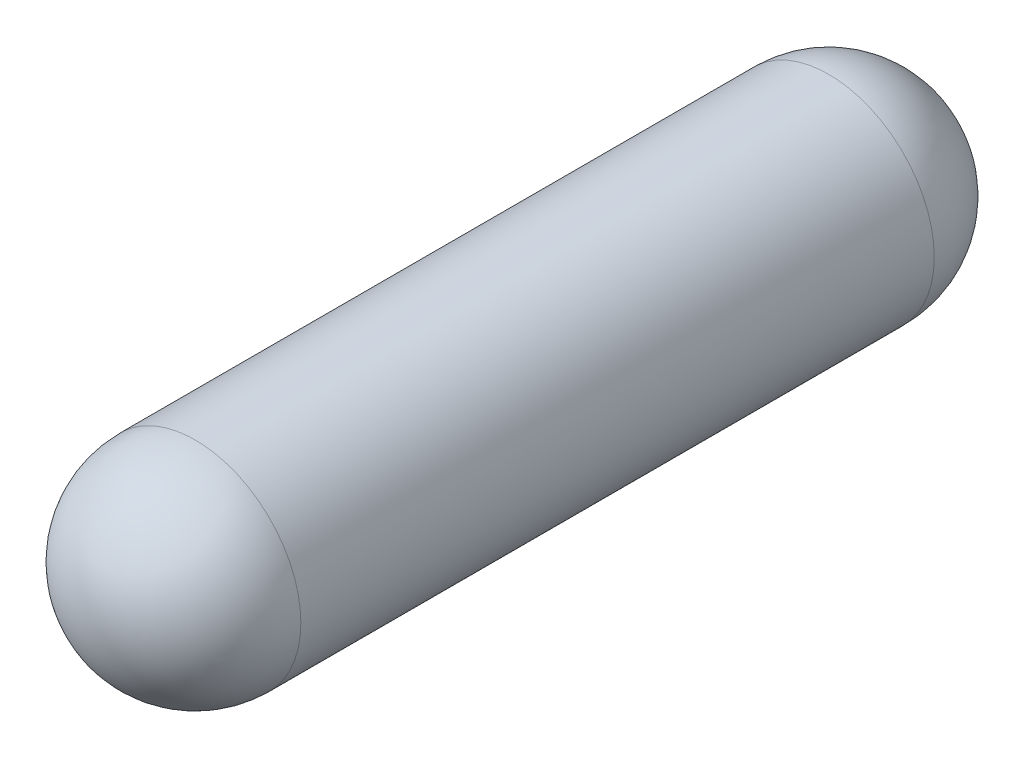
ISO-10303-21;
HEADER;
FILE_DESCRIPTION(('STEP AP214'),'2;1');
FILE_NAME('part.step','',(''),(''),'','','');
FILE_SCHEMA(('AUTOMOTIVE_DESIGN { 1 0 10303 214 1 1 1 1 }'));
ENDSEC;
DATA;
#1=APPLICATION_CONTEXT('core data for automotive mechanical design processes');
#2=APPLICATION_PROTOCOL_DEFINITION('international standard','automotive_design',2000,#1);
#3=PRODUCT_CONTEXT('',#1,'mechanical');
#4=PRODUCT('Part','Part','',(#3));
#5=PRODUCT_RELATED_PRODUCT_CATEGORY('part','',(#4));
#6=PRODUCT_DEFINITION_FORMATION('','',#4);
#7=PRODUCT_DEFINITION_CONTEXT('part definition',#1,'design');
#8=PRODUCT_DEFINITION('design','',#6,#7);
#9=PRODUCT_DEFINITION_SHAPE('','',#8);
#10=(LENGTH_UNIT() NAMED_UNIT(*) SI_UNIT(.MILLI.,.METRE.));
#11=(NAMED_UNIT(*) PLANE_ANGLE_UNIT() SI_UNIT($,.RADIAN.));
#12=(NAMED_UNIT(*) SI_UNIT($,.STERADIAN.) SOLID_ANGLE_UNIT());
#13=UNCERTAINTY_MEASURE_WITH_UNIT(LENGTH_MEASURE(1.E-05),#10,'distance_accuracy_value','');
#14=(GEOMETRIC_REPRESENTATION_CONTEXT(3) GLOBAL_UNCERTAINTY_ASSIGNED_CONTEXT((#13)) GLOBAL_UNIT_ASSIGNED_CONTEXT((#10,
#11,#12)) REPRESENTATION_CONTEXT('',''));
#15=CARTESIAN_POINT('',(0.,0.,0.));
#16=DIRECTION('',(0.,0.,1.));
#17=DIRECTION('',(1.,0.,0.));
#18=AXIS2_PLACEMENT_3D('',#15,#16,#17);
#19=CARTESIAN_POINT('',(0.,0.,3.));
#20=DIRECTION('',(0.,0.,-1.));
#21=DIRECTION('',(-1.,0.,0.));
#22=AXIS2_PLACEMENT_3D('',#19,#20,#21);
#23=CYLINDRICAL_SURFACE('',#22,1.);
#24=CARTESIAN_POINT('',(0.,0.,3.));
#25=DIRECTION('',(0.,0.,1.));
#26=DIRECTION('',(1.,0.,0.));
#27=AXIS2_PLACEMENT_3D('',#24,#25,#26);
#28=CIRCLE('',#27,1.);
#29=CARTESIAN_POINT('',(1.,0.,3.));
#30=VERTEX_POINT('',#29);
#31=EDGE_CURVE('E10',#30,#30,#28,.T.);
#32=ORIENTED_EDGE('',*,*,#31,.F.);
#33=EDGE_LOOP('',(#32));
#34=FACE_BOUND('',#33,.T.);
#35=CARTESIAN_POINT('',(0.,0.,-3.));
#36=DIRECTION('',(0.,0.,1.));
#37=DIRECTION('',(1.,0.,0.));
#38=AXIS2_PLACEMENT_3D('',#35,#36,#37);
#39=CIRCLE('',#38,1.);
#40=CARTESIAN_POINT('',(1.,0.,-3.));
#41=VERTEX_POINT('',#40);
#42=EDGE_CURVE('E355',#41,#41,#39,.T.);
#43=ORIENTED_EDGE('',*,*,#42,.T.);
#44=EDGE_LOOP('',(#43));
#45=FACE_BOUND('',#44,.T.);
#46=ADVANCED_FACE('F348',(#34,#45),#23,.T.);
#47=CARTESIAN_POINT('',(0.,0.,3.));
#48=DIRECTION('',(0.,0.,1.));
#49=DIRECTION('',(1.,0.,0.));
#50=AXIS2_PLACEMENT_3D('',#47,#48,#49);
#51=SPHERICAL_SURFACE('',#50,1.);
#52=ORIENTED_EDGE('',*,*,#31,.T.);
#53=EDGE_LOOP('',(#52));
#54=FACE_BOUND('',#53,.T.);
#55=ADVANCED_FACE('F350',(#54),#51,.T.);
#56=CARTESIAN_POINT('',(0.,0.,-3.));
#57=DIRECTION('',(0.,0.,1.));
#58=DIRECTION('',(1.,0.,0.));
#59=AXIS2_PLACEMENT_3D('',#56,#57,#58);
#60=SPHERICAL_SURFACE('',#59,1.);
#61=ORIENTED_EDGE('',*,*,#42,.F.);
#62=EDGE_LOOP('',(#61));
#63=FACE_BOUND('',#62,.T.);
#64=ADVANCED_FACE('F362',(#63),#60,.T.);
#65=CLOSED_SHELL('',(#46,#55,#64));
#66=MANIFOLD_SOLID_BREP('B2',#65);
#67=ADVANCED_BREP_SHAPE_REPRESENTATION('',(#18,#66),#14);
#68=SHAPE_DEFINITION_REPRESENTATION(#9,#67);
ENDSEC;
END-ISO-10303-21;
